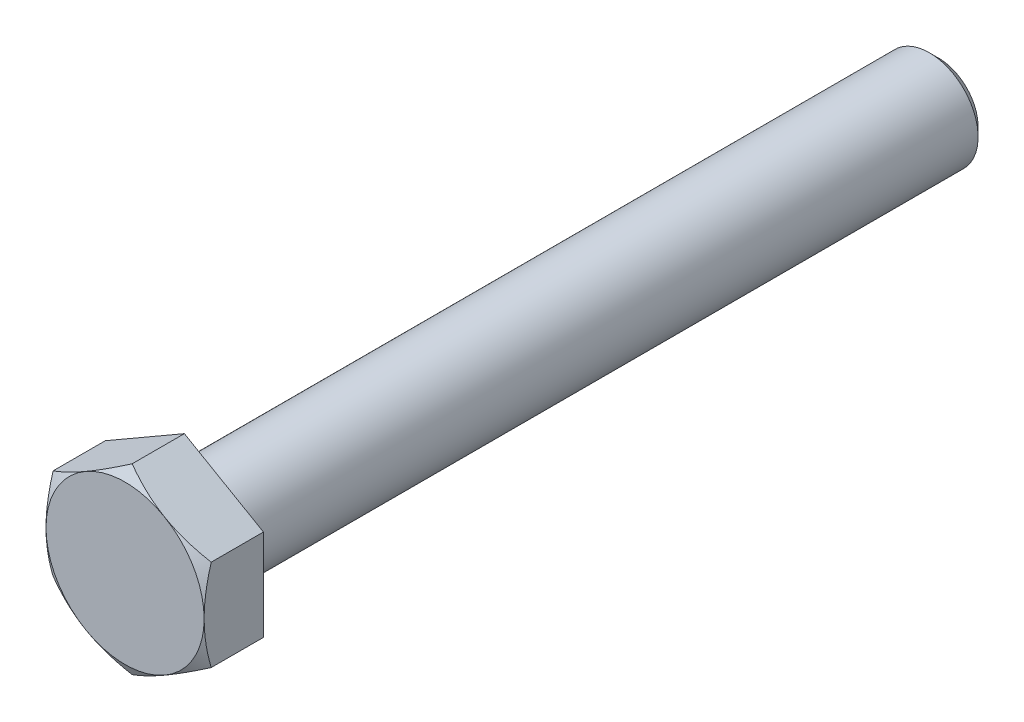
ISO-10303-21;
HEADER;
FILE_DESCRIPTION(('STEP AP214'),'2;1');
FILE_NAME('part.step','',(''),(''),'','','');
FILE_SCHEMA(('AUTOMOTIVE_DESIGN { 1 0 10303 214 1 1 1 1 }'));
ENDSEC;
DATA;
#1=APPLICATION_CONTEXT('core data for automotive mechanical design processes');
#2=APPLICATION_PROTOCOL_DEFINITION('international standard','automotive_design',2000,#1);
#3=PRODUCT_CONTEXT('',#1,'mechanical');
#4=PRODUCT('Part','Part','',(#3));
#5=PRODUCT_RELATED_PRODUCT_CATEGORY('part','',(#4));
#6=PRODUCT_DEFINITION_FORMATION('','',#4);
#7=PRODUCT_DEFINITION_CONTEXT('part definition',#1,'design');
#8=PRODUCT_DEFINITION('design','',#6,#7);
#9=PRODUCT_DEFINITION_SHAPE('','',#8);
#10=(LENGTH_UNIT() NAMED_UNIT(*) SI_UNIT(.MILLI.,.METRE.));
#11=(NAMED_UNIT(*) PLANE_ANGLE_UNIT() SI_UNIT($,.RADIAN.));
#12=(NAMED_UNIT(*) SI_UNIT($,.STERADIAN.) SOLID_ANGLE_UNIT());
#13=UNCERTAINTY_MEASURE_WITH_UNIT(LENGTH_MEASURE(1.E-05),#10,'distance_accuracy_value','');
#14=(GEOMETRIC_REPRESENTATION_CONTEXT(3) GLOBAL_UNCERTAINTY_ASSIGNED_CONTEXT((#13)) GLOBAL_UNIT_ASSIGNED_CONTEXT((#10,
#11,#12)) REPRESENTATION_CONTEXT('',''));
#15=CARTESIAN_POINT('',(0.,0.,0.));
#16=DIRECTION('',(0.,0.,1.));
#17=DIRECTION('',(1.,0.,0.));
#18=AXIS2_PLACEMENT_3D('',#15,#16,#17);
#19=CARTESIAN_POINT('',(0.,-23.8301323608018,27.6373335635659));
#20=DIRECTION('',(0.5,-0.866025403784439,0.));
#21=DIRECTION('',(0.866025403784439,0.5,0.));
#22=AXIS2_PLACEMENT_3D('',#19,#20,#21);
#23=PLANE('',#22);
#24=DIRECTION('',(0.,0.,1.));
#25=VECTOR('',#24,1.);
#26=CARTESIAN_POINT('',(20.6375,-11.9150661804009,27.6373335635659));
#27=LINE('',#26,#25);
#28=CARTESIAN_POINT('',(20.6375,-11.9150661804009,90.6859375));
#29=VERTEX_POINT('',#28);
#30=CARTESIAN_POINT('',(20.6375,-11.9150661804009,104.320795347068));
#31=VERTEX_POINT('',#30);
#32=EDGE_CURVE('E151',#29,#31,#27,.T.);
#33=ORIENTED_EDGE('',*,*,#32,.T.);
#34=CARTESIAN_POINT('',(20.6377,-11.9149507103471,104.320728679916));
#35=CARTESIAN_POINT('',(20.1840964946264,-12.1768388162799,104.471919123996));
#36=CARTESIAN_POINT('',(19.7287236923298,-12.4397484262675,104.616248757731));
#37=CARTESIAN_POINT('',(18.814326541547,-12.9676758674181,104.889279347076));
#38=CARTESIAN_POINT('',(18.3553010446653,-13.2326943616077,105.017975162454));
#39=CARTESIAN_POINT('',(17.4327113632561,-13.7653517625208,105.258008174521));
#40=CARTESIAN_POINT('',(16.9691391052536,-14.0329953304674,105.369304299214));
#41=CARTESIAN_POINT('',(16.0387734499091,-14.5701421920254,105.572148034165));
#42=CARTESIAN_POINT('',(15.571980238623,-14.8396453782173,105.663696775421));
#43=CARTESIAN_POINT('',(14.6471334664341,-15.3736059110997,105.823151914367));
#44=CARTESIAN_POINT('',(14.1891485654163,-15.6380236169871,105.891586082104));
#45=CARTESIAN_POINT('',(13.27108023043,-16.1680706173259,106.006334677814));
#46=CARTESIAN_POINT('',(12.8109967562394,-16.4336999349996,106.052648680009));
#47=CARTESIAN_POINT('',(11.890056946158,-16.9654047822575,106.12198753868));
#48=CARTESIAN_POINT('',(11.4292021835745,-17.2314794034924,106.145040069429));
#49=CARTESIAN_POINT('',(10.5070673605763,-17.7638741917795,106.167360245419));
#50=CARTESIAN_POINT('',(10.045787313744,-18.03019435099,106.166628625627));
#51=CARTESIAN_POINT('',(9.18341530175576,-18.528085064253,106.143041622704));
#52=CARTESIAN_POINT('',(8.78226192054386,-18.759691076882,106.123062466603));
#53=CARTESIAN_POINT('',(7.98091285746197,-19.2223501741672,106.065495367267));
#54=CARTESIAN_POINT('',(7.58071716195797,-19.453403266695,106.027907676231));
#55=CARTESIAN_POINT('',(6.78143133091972,-19.9148711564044,105.935774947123));
#56=CARTESIAN_POINT('',(6.38234252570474,-20.1452851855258,105.881214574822));
#57=CARTESIAN_POINT('',(5.5860758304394,-20.605009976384,105.756102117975));
#58=CARTESIAN_POINT('',(5.1888979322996,-20.8343207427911,105.685550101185));
#59=CARTESIAN_POINT('',(3.98315033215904,-21.530459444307,105.448095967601));
#60=CARTESIAN_POINT('',(3.17800639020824,-21.9953095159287,105.257504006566));
#61=CARTESIAN_POINT('',(1.97918213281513,-22.6874510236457,104.933030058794));
#62=CARTESIAN_POINT('',(1.58139951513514,-22.9171109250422,104.818557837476));
#63=CARTESIAN_POINT('',(0.788585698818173,-23.37484219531,104.578024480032));
#64=CARTESIAN_POINT('',(0.393553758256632,-23.6029139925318,104.451966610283));
#65=CARTESIAN_POINT('',(-0.000199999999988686,-23.8302478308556,104.320728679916));
#66=B_SPLINE_CURVE_WITH_KNOTS('',3,(#34,#35,#36,#37,#38,#39,#40,#41,#42,#43,#44,#45,#46,#47,#48,
#49,#50,#51,#52,#53,#54,#55,#56,#57,#58,#59,#60,#61,#62,#63,#64,#65),.UNSPECIFIED.,.F.,.F.,(4,2,
2,2,2,2,2,2,2,2,2,2,2,2,2,4),(0.,1.63552456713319,3.27158542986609,4.91145173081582,
6.55122408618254,8.1505234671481,9.74985363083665,11.3472788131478,12.9446546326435,
14.3352468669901,15.7258191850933,17.1176515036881,18.5094779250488,21.3544387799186,
22.7744411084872,24.1940443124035),.UNSPECIFIED.);
#67=CARTESIAN_POINT('',(10.31875,-17.8725992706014,106.1640625));
#68=VERTEX_POINT('',#67);
#69=EDGE_CURVE('E267',#31,#68,#66,.T.);
#70=ORIENTED_EDGE('',*,*,#69,.T.);
#71=CARTESIAN_POINT('',(0.,-23.8301323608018,104.320795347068));
#72=VERTEX_POINT('',#71);
#73=EDGE_CURVE('E194',#68,#72,#66,.T.);
#74=ORIENTED_EDGE('',*,*,#73,.T.);
#75=DIRECTION('',(0.,0.,1.));
#76=VECTOR('',#75,1.);
#77=CARTESIAN_POINT('',(0.,-23.8301323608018,27.6373335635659));
#78=LINE('',#77,#76);
#79=CARTESIAN_POINT('',(0.,-23.8301323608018,90.6859375));
#80=VERTEX_POINT('',#79);
#81=EDGE_CURVE('E287',#80,#72,#78,.T.);
#82=ORIENTED_EDGE('',*,*,#81,.F.);
#83=DIRECTION('',(0.866025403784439,0.5,0.));
#84=VECTOR('',#83,1.);
#85=CARTESIAN_POINT('',(0.,-23.8301323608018,90.6859375));
#86=LINE('',#85,#84);
#87=EDGE_CURVE('E149',#80,#29,#86,.T.);
#88=ORIENTED_EDGE('',*,*,#87,.T.);
#89=EDGE_LOOP('',(#33,#70,#74,#82,#88));
#90=FACE_BOUND('',#89,.T.);
#91=ADVANCED_FACE('F42',(#90),#23,.T.);
#92=CARTESIAN_POINT('',(20.6375,-11.9150661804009,27.6373335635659));
#93=DIRECTION('',(1.,0.,0.));
#94=DIRECTION('',(0.,0.,-1.));
#95=AXIS2_PLACEMENT_3D('',#92,#93,#94);
#96=PLANE('',#95);
#97=DIRECTION('',(0.,0.,1.));
#98=VECTOR('',#97,1.);
#99=CARTESIAN_POINT('',(20.6375,11.9150661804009,27.6373335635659));
#100=LINE('',#99,#98);
#101=CARTESIAN_POINT('',(20.6375,11.9150661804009,90.6859375));
#102=VERTEX_POINT('',#101);
#103=CARTESIAN_POINT('',(20.6375,11.9150661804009,104.320795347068));
#104=VERTEX_POINT('',#103);
#105=EDGE_CURVE('E300',#102,#104,#100,.T.);
#106=ORIENTED_EDGE('',*,*,#105,.T.);
#107=CARTESIAN_POINT('',(20.6375,-32.4256154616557,95.888087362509));
#108=CARTESIAN_POINT('',(20.6375,-31.9730806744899,96.1084981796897));
#109=CARTESIAN_POINT('',(20.6375,-31.5200260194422,96.3278411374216));
#110=CARTESIAN_POINT('',(20.6375,-30.612768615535,96.7641502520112));
#111=CARTESIAN_POINT('',(20.6375,-30.1585658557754,96.9811163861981));
#112=CARTESIAN_POINT('',(20.6375,-28.7939575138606,97.6281424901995));
#113=CARTESIAN_POINT('',(20.6375,-27.8816794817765,98.0542678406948));
#114=CARTESIAN_POINT('',(20.6375,-26.0463911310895,98.895731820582));
#115=CARTESIAN_POINT('',(20.6375,-25.123349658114,99.3110026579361));
#116=CARTESIAN_POINT('',(20.6375,-23.2700704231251,100.125105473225));
#117=CARTESIAN_POINT('',(20.6375,-22.3398329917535,100.523938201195));
#118=CARTESIAN_POINT('',(20.6375,-20.439323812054,101.313861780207));
#119=CARTESIAN_POINT('',(20.6375,-19.4687560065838,101.704243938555));
#120=CARTESIAN_POINT('',(20.6375,-17.5164156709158,102.456468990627));
#121=CARTESIAN_POINT('',(20.6375,-16.5346419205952,102.818308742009));
#122=CARTESIAN_POINT('',(20.6375,-14.5600631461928,103.504252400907));
#123=CARTESIAN_POINT('',(20.6375,-13.5672836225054,103.828429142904));
#124=CARTESIAN_POINT('',(20.6375,-11.5673985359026,104.428944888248));
#125=CARTESIAN_POINT('',(20.6375,-10.560297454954,104.705298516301));
#126=CARTESIAN_POINT('',(20.6375,-9.04144034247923,105.073428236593));
#127=CARTESIAN_POINT('',(20.6375,-8.53521428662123,105.188147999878));
#128=CARTESIAN_POINT('',(20.6375,-7.51922760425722,105.400787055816));
#129=CARTESIAN_POINT('',(20.6375,-7.00946704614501,105.498706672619));
#130=CARTESIAN_POINT('',(20.6375,-5.98674447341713,105.67604186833));
#131=CARTESIAN_POINT('',(20.6375,-5.47378260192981,105.755458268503));
#132=CARTESIAN_POINT('',(20.6375,-4.44513343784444,105.894225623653));
#133=CARTESIAN_POINT('',(20.6375,-3.92944614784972,105.953576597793));
#134=CARTESIAN_POINT('',(20.6375,-2.90301545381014,106.050260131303));
#135=CARTESIAN_POINT('',(20.6375,-2.39229917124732,106.087878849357));
#136=CARTESIAN_POINT('',(20.6375,-1.36973286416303,106.141466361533));
#137=CARTESIAN_POINT('',(20.6375,-0.857882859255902,106.157435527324));
#138=CARTESIAN_POINT('',(20.6375,0.166038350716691,106.167342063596));
#139=CARTESIAN_POINT('',(20.6375,0.678109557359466,106.161279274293));
#140=CARTESIAN_POINT('',(20.6375,1.70153150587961,106.127274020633));
#141=CARTESIAN_POINT('',(20.6375,2.21288221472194,106.099330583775));
#142=CARTESIAN_POINT('',(20.6375,3.42907871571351,106.007452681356));
#143=CARTESIAN_POINT('',(20.6375,4.13320752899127,105.933846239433));
#144=CARTESIAN_POINT('',(20.6375,5.53651886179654,105.749054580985));
#145=CARTESIAN_POINT('',(20.6375,6.23570074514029,105.637864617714));
#146=CARTESIAN_POINT('',(20.6375,7.6283451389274,105.381860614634));
#147=CARTESIAN_POINT('',(20.6375,8.32180314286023,105.237022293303));
#148=CARTESIAN_POINT('',(20.6375,9.70190431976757,104.918160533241));
#149=CARTESIAN_POINT('',(20.6375,10.3885475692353,104.744137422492));
#150=CARTESIAN_POINT('',(20.6375,11.7709004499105,104.366836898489));
#151=CARTESIAN_POINT('',(20.6375,12.4664487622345,104.162972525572));
#152=CARTESIAN_POINT('',(20.6375,13.8506972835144,103.733309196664));
#153=CARTESIAN_POINT('',(20.6375,14.5393974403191,103.507510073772));
#154=CARTESIAN_POINT('',(20.6375,15.9102893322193,103.037636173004));
#155=CARTESIAN_POINT('',(20.6375,16.5924828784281,102.79356665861));
#156=CARTESIAN_POINT('',(20.6375,17.611479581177,102.415977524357));
#157=CARTESIAN_POINT('',(20.6375,17.9504279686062,102.288200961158));
#158=CARTESIAN_POINT('',(20.6375,18.6269817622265,102.029136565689));
#159=CARTESIAN_POINT('',(20.6375,18.9645871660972,101.897848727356));
#160=CARTESIAN_POINT('',(20.6375,19.8670735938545,101.541934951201));
#161=CARTESIAN_POINT('',(20.6375,20.4308061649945,101.314394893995));
#162=CARTESIAN_POINT('',(20.6375,21.5550661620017,100.851514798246));
#163=CARTESIAN_POINT('',(20.6375,22.1155935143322,100.61617458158));
#164=CARTESIAN_POINT('',(20.6375,23.233806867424,100.138722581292));
#165=CARTESIAN_POINT('',(20.6375,23.7914926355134,99.8966102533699));
#166=CARTESIAN_POINT('',(20.6375,24.9042782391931,99.4065084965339));
#167=CARTESIAN_POINT('',(20.6375,25.4593780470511,99.1585190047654));
#168=CARTESIAN_POINT('',(20.6375,27.1216033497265,98.4067109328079));
#169=CARTESIAN_POINT('',(20.6375,28.2252618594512,97.8952217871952));
#170=CARTESIAN_POINT('',(20.6375,30.4250858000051,96.8565590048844));
#171=CARTESIAN_POINT('',(20.6375,31.5212515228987,96.3293859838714));
#172=CARTESIAN_POINT('',(20.6375,33.709278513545,95.2618893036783));
#173=CARTESIAN_POINT('',(20.6375,34.8011303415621,94.7215463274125));
#174=CARTESIAN_POINT('',(20.6375,36.9799230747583,93.6310445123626));
#175=CARTESIAN_POINT('',(20.6375,38.0668639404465,93.0808855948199));
#176=CARTESIAN_POINT('',(20.6375,40.2364746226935,91.9727781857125));
#177=CARTESIAN_POINT('',(20.6375,41.3191452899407,91.4148313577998));
#178=CARTESIAN_POINT('',(20.6375,43.4811328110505,90.292491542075));
#179=CARTESIAN_POINT('',(20.6375,44.5604496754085,89.7280985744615));
#180=CARTESIAN_POINT('',(20.6375,46.6038665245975,88.6531275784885));
#181=CARTESIAN_POINT('',(20.6375,47.5682435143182,88.1430756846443));
#182=CARTESIAN_POINT('',(20.6375,49.4950666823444,87.1193366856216));
#183=CARTESIAN_POINT('',(20.6375,50.4575128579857,86.6056495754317));
#184=CARTESIAN_POINT('',(20.6375,53.3424750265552,85.059887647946));
#185=CARTESIAN_POINT('',(20.6375,55.2625043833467,84.0231704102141));
#186=CARTESIAN_POINT('',(20.6375,58.1356204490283,82.4628746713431));
#187=CARTESIAN_POINT('',(20.6375,59.0905984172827,81.9427700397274));
#188=CARTESIAN_POINT('',(20.6375,60.999450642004,80.9005377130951));
#189=CARTESIAN_POINT('',(20.6375,61.9533248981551,80.3784100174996));
#190=CARTESIAN_POINT('',(20.6375,63.8600285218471,79.3324241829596));
#191=CARTESIAN_POINT('',(20.6375,64.8128579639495,78.8085661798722));
#192=CARTESIAN_POINT('',(20.6375,66.7176507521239,77.7592806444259));
#193=CARTESIAN_POINT('',(20.6375,67.6696140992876,77.2338531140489));
#194=CARTESIAN_POINT('',(20.6375,68.6211983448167,76.7077405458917));
#195=B_SPLINE_CURVE_WITH_KNOTS('',3,(#107,#108,#109,#110,#111,#112,#113,#114,#115,#116,#117,
#118,#119,#120,#121,#122,#123,#124,#125,#126,#127,#128,#129,#130,#131,#132,#133,#134,#135,#136,
#137,#138,#139,#140,#141,#142,#143,#144,#145,#146,#147,#148,#149,#150,#151,#152,#153,#154,#155,
#156,#157,#158,#159,#160,#161,#162,#163,#164,#165,#166,#167,#168,#169,#170,#171,#172,#173,#174,
#175,#176,#177,#178,#179,#180,#181,#182,#183,#184,#185,#186,#187,#188,#189,#190,#191,#192,#193,
#194),.UNSPECIFIED.,.F.,.F.,(4,2,2,2,2,2,2,2,2,2,2,2,2,2,2,2,2,2,2,2,2,2,2,2,2,2,2,2,2,2,2,2,2,
2,2,2,2,2,2,2,2,2,2,4),(0.,1.51006956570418,3.02015352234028,6.04074746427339,9.07708394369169,
12.1132817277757,15.2513462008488,18.3897556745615,21.5219911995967,24.6532671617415,
26.2102197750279,27.7671423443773,29.3239957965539,30.8808477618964,32.4167030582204,
33.9525319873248,35.4883720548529,37.024280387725,39.1470128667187,41.2700135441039,
43.3945510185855,45.5190646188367,47.6930602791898,49.867072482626,52.0404607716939,
53.1271447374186,54.2138305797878,56.0375227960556,57.8612566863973,59.6851375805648,
61.5090379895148,65.1581216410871,68.807062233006,72.4617221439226,76.1164113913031,
79.7703315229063,83.4242402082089,86.6970868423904,89.9699379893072,96.5160143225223,
99.7782862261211,103.040559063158,106.302581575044,109.564599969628),.UNSPECIFIED.);
#196=CARTESIAN_POINT('',(20.6375,0.,106.1640625));
#197=VERTEX_POINT('',#196);
#198=EDGE_CURVE('E118',#104,#197,#195,.F.);
#199=ORIENTED_EDGE('',*,*,#198,.T.);
#200=EDGE_CURVE('E158',#197,#31,#195,.F.);
#201=ORIENTED_EDGE('',*,*,#200,.T.);
#202=ORIENTED_EDGE('',*,*,#32,.F.);
#203=DIRECTION('',(0.,1.,0.));
#204=VECTOR('',#203,1.);
#205=CARTESIAN_POINT('',(20.6375,-11.9150661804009,90.6859375));
#206=LINE('',#205,#204);
#207=EDGE_CURVE('E293',#29,#102,#206,.T.);
#208=ORIENTED_EDGE('',*,*,#207,.T.);
#209=EDGE_LOOP('',(#106,#199,#201,#202,#208));
#210=FACE_BOUND('',#209,.T.);
#211=ADVANCED_FACE('F225',(#210),#96,.T.);
#212=CARTESIAN_POINT('',(20.6375,11.9150661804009,27.6373335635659));
#213=DIRECTION('',(0.5,0.866025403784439,0.));
#214=DIRECTION('',(-0.866025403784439,0.5,0.));
#215=AXIS2_PLACEMENT_3D('',#212,#213,#214);
#216=PLANE('',#215);
#217=DIRECTION('',(0.,0.,1.));
#218=VECTOR('',#217,1.);
#219=CARTESIAN_POINT('',(0.,23.8301323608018,27.6373335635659));
#220=LINE('',#219,#218);
#221=CARTESIAN_POINT('',(0.,23.8301323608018,90.6859375));
#222=VERTEX_POINT('',#221);
#223=CARTESIAN_POINT('',(0.,23.8301323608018,104.320795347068));
#224=VERTEX_POINT('',#223);
#225=EDGE_CURVE('E148',#222,#224,#220,.T.);
#226=ORIENTED_EDGE('',*,*,#225,.T.);
#227=CARTESIAN_POINT('',(-0.000199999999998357,23.8302478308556,104.320728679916));
#228=CARTESIAN_POINT('',(0.453403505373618,23.5683597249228,104.471919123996));
#229=CARTESIAN_POINT('',(0.908776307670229,23.3054501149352,104.616248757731));
#230=CARTESIAN_POINT('',(1.82317345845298,22.7775226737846,104.889279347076));
#231=CARTESIAN_POINT('',(2.2821989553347,22.512504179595,105.017975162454));
#232=CARTESIAN_POINT('',(3.20478863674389,21.9798467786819,105.258008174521));
#233=CARTESIAN_POINT('',(3.66836089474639,21.7122032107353,105.369304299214));
#234=CARTESIAN_POINT('',(4.59872655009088,21.1750563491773,105.572148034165));
#235=CARTESIAN_POINT('',(5.06551976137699,20.9055531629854,105.663696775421));
#236=CARTESIAN_POINT('',(5.99036653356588,20.371592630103,105.823151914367));
#237=CARTESIAN_POINT('',(6.44835143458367,20.1071749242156,105.891586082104));
#238=CARTESIAN_POINT('',(7.36641976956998,19.5771279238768,106.006334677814));
#239=CARTESIAN_POINT('',(7.82650324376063,19.3114986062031,106.052648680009));
#240=CARTESIAN_POINT('',(8.74744305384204,18.7797937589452,106.12198753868));
#241=CARTESIAN_POINT('',(9.20829781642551,18.5137191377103,106.145040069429));
#242=CARTESIAN_POINT('',(10.1304326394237,17.9813243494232,106.167360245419));
#243=CARTESIAN_POINT('',(10.591712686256,17.7150041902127,106.166628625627));
#244=CARTESIAN_POINT('',(11.4540846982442,17.2171134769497,106.143041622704));
#245=CARTESIAN_POINT('',(11.8552380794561,16.9855074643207,106.123062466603));
#246=CARTESIAN_POINT('',(12.656587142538,16.5228483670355,106.065495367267));
#247=CARTESIAN_POINT('',(13.056782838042,16.2917952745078,106.027907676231));
#248=CARTESIAN_POINT('',(13.8560686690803,15.8303273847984,105.935774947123));
#249=CARTESIAN_POINT('',(14.2551574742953,15.5999133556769,105.881214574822));
#250=CARTESIAN_POINT('',(15.0514241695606,15.1401885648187,105.756102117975));
#251=CARTESIAN_POINT('',(15.4486020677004,14.9108777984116,105.685550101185));
#252=CARTESIAN_POINT('',(16.654349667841,14.2147390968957,105.448095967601));
#253=CARTESIAN_POINT('',(17.4594936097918,13.749889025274,105.257504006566));
#254=CARTESIAN_POINT('',(18.6583178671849,13.057747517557,104.933030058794));
#255=CARTESIAN_POINT('',(19.0561004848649,12.8280876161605,104.818557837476));
#256=CARTESIAN_POINT('',(19.8489143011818,12.3703563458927,104.578024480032));
#257=CARTESIAN_POINT('',(20.2439462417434,12.1422845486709,104.451966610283));
#258=CARTESIAN_POINT('',(20.6377,11.9149507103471,104.320728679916));
#259=B_SPLINE_CURVE_WITH_KNOTS('',3,(#227,#228,#229,#230,#231,#232,#233,#234,#235,#236,#237,
#238,#239,#240,#241,#242,#243,#244,#245,#246,#247,#248,#249,#250,#251,#252,#253,#254,#255,#256,
#257,#258),.UNSPECIFIED.,.F.,.F.,(4,2,2,2,2,2,2,2,2,2,2,2,2,2,2,4),(0.,1.63552456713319,
3.27158542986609,4.91145173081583,6.55122408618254,8.1505234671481,9.74985363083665,
11.3472788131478,12.9446546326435,14.3352468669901,15.7258191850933,17.1176515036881,
18.5094779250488,21.3544387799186,22.7744411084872,24.1940443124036),.UNSPECIFIED.);
#260=CARTESIAN_POINT('',(10.31875,17.8725992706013,106.1640625));
#261=VERTEX_POINT('',#260);
#262=EDGE_CURVE('E123',#224,#261,#259,.T.);
#263=ORIENTED_EDGE('',*,*,#262,.T.);
#264=EDGE_CURVE('E114',#261,#104,#259,.T.);
#265=ORIENTED_EDGE('',*,*,#264,.T.);
#266=ORIENTED_EDGE('',*,*,#105,.F.);
#267=DIRECTION('',(-0.866025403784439,0.5,0.));
#268=VECTOR('',#267,1.);
#269=CARTESIAN_POINT('',(20.6375,11.9150661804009,90.6859375));
#270=LINE('',#269,#268);
#271=EDGE_CURVE('E297',#102,#222,#270,.T.);
#272=ORIENTED_EDGE('',*,*,#271,.T.);
#273=EDGE_LOOP('',(#226,#263,#265,#266,#272));
#274=FACE_BOUND('',#273,.T.);
#275=ADVANCED_FACE('F142',(#274),#216,.T.);
#276=CARTESIAN_POINT('',(0.,23.8301323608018,27.6373335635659));
#277=DIRECTION('',(-0.5,0.866025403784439,0.));
#278=DIRECTION('',(-0.866025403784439,-0.5,0.));
#279=AXIS2_PLACEMENT_3D('',#276,#277,#278);
#280=PLANE('',#279);
#281=DIRECTION('',(0.,0.,1.));
#282=VECTOR('',#281,1.);
#283=CARTESIAN_POINT('',(-20.6375,11.9150661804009,27.6373335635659));
#284=LINE('',#283,#282);
#285=CARTESIAN_POINT('',(-20.6375,11.9150661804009,90.6859375));
#286=VERTEX_POINT('',#285);
#287=CARTESIAN_POINT('',(-20.6375,11.9150661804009,104.320795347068));
#288=VERTEX_POINT('',#287);
#289=EDGE_CURVE('E290',#286,#288,#284,.T.);
#290=ORIENTED_EDGE('',*,*,#289,.T.);
#291=CARTESIAN_POINT('',(-20.6377,11.9149507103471,104.320728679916));
#292=CARTESIAN_POINT('',(-20.1840964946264,12.1768388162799,104.471919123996));
#293=CARTESIAN_POINT('',(-19.7287236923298,12.4397484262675,104.616248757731));
#294=CARTESIAN_POINT('',(-18.814326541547,12.9676758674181,104.889279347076));
#295=CARTESIAN_POINT('',(-18.3553010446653,13.2326943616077,105.017975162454));
#296=CARTESIAN_POINT('',(-17.4327113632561,13.7653517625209,105.258008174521));
#297=CARTESIAN_POINT('',(-16.9691391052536,14.0329953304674,105.369304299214));
#298=CARTESIAN_POINT('',(-16.0387734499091,14.5701421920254,105.572148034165));
#299=CARTESIAN_POINT('',(-15.571980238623,14.8396453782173,105.663696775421));
#300=CARTESIAN_POINT('',(-14.6471334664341,15.3736059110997,105.823151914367));
#301=CARTESIAN_POINT('',(-14.1891485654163,15.6380236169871,105.891586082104));
#302=CARTESIAN_POINT('',(-13.27108023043,16.1680706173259,106.006334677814));
#303=CARTESIAN_POINT('',(-12.8109967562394,16.4336999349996,106.052648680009));
#304=CARTESIAN_POINT('',(-11.890056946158,16.9654047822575,106.12198753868));
#305=CARTESIAN_POINT('',(-11.4292021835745,17.2314794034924,106.145040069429));
#306=CARTESIAN_POINT('',(-10.5070673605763,17.7638741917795,106.167360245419));
#307=CARTESIAN_POINT('',(-10.045787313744,18.03019435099,106.166628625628));
#308=CARTESIAN_POINT('',(-9.18341530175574,18.528085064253,106.143041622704));
#309=CARTESIAN_POINT('',(-8.78226192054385,18.759691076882,106.123062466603));
#310=CARTESIAN_POINT('',(-7.98091285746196,19.2223501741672,106.065495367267));
#311=CARTESIAN_POINT('',(-7.58071716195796,19.453403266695,106.027907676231));
#312=CARTESIAN_POINT('',(-6.78143133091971,19.9148711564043,105.935774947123));
#313=CARTESIAN_POINT('',(-6.38234252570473,20.1452851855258,105.881214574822));
#314=CARTESIAN_POINT('',(-5.58607583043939,20.605009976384,105.756102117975));
#315=CARTESIAN_POINT('',(-5.18889793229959,20.8343207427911,105.685550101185));
#316=CARTESIAN_POINT('',(-3.98315033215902,21.530459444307,105.448095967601));
#317=CARTESIAN_POINT('',(-3.17800639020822,21.9953095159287,105.257504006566));
#318=CARTESIAN_POINT('',(-1.97918213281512,22.6874510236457,104.933030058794));
#319=CARTESIAN_POINT('',(-1.58139951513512,22.9171109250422,104.818557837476));
#320=CARTESIAN_POINT('',(-0.788585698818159,23.37484219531,104.578024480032));
#321=CARTESIAN_POINT('',(-0.39355375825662,23.6029139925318,104.451966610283));
#322=CARTESIAN_POINT('',(0.00020000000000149,23.8302478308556,104.320728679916));
#323=B_SPLINE_CURVE_WITH_KNOTS('',3,(#291,#292,#293,#294,#295,#296,#297,#298,#299,#300,#301,
#302,#303,#304,#305,#306,#307,#308,#309,#310,#311,#312,#313,#314,#315,#316,#317,#318,#319,#320,
#321,#322),.UNSPECIFIED.,.F.,.F.,(4,2,2,2,2,2,2,2,2,2,2,2,2,2,2,4),(0.,1.63552456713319,
3.27158542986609,4.91145173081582,6.55122408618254,8.1505234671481,9.74985363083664,
11.3472788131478,12.9446546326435,14.3352468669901,15.7258191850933,17.1176515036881,
18.5094779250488,21.3544387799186,22.7744411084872,24.1940443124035),.UNSPECIFIED.);
#324=CARTESIAN_POINT('',(-10.31875,17.8725992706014,106.1640625));
#325=VERTEX_POINT('',#324);
#326=EDGE_CURVE('E201',#288,#325,#323,.T.);
#327=ORIENTED_EDGE('',*,*,#326,.T.);
#328=EDGE_CURVE('E122',#325,#224,#323,.T.);
#329=ORIENTED_EDGE('',*,*,#328,.T.);
#330=ORIENTED_EDGE('',*,*,#225,.F.);
#331=DIRECTION('',(-0.866025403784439,-0.5,0.));
#332=VECTOR('',#331,1.);
#333=CARTESIAN_POINT('',(0.,23.8301323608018,90.6859375));
#334=LINE('',#333,#332);
#335=EDGE_CURVE('E294',#222,#286,#334,.T.);
#336=ORIENTED_EDGE('',*,*,#335,.T.);
#337=EDGE_LOOP('',(#290,#327,#329,#330,#336));
#338=FACE_BOUND('',#337,.T.);
#339=ADVANCED_FACE('F210',(#338),#280,.T.);
#340=CARTESIAN_POINT('',(-20.6375,11.9150661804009,27.6373335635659));
#341=DIRECTION('',(-1.,0.,0.));
#342=DIRECTION('',(0.,-1.,0.));
#343=AXIS2_PLACEMENT_3D('',#340,#341,#342);
#344=PLANE('',#343);
#345=DIRECTION('',(0.,0.,1.));
#346=VECTOR('',#345,1.);
#347=CARTESIAN_POINT('',(-20.6375,-11.9150661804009,27.6373335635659));
#348=LINE('',#347,#346);
#349=CARTESIAN_POINT('',(-20.6375,-11.9150661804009,90.6859375));
#350=VERTEX_POINT('',#349);
#351=CARTESIAN_POINT('',(-20.6375,-11.9150661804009,104.320795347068));
#352=VERTEX_POINT('',#351);
#353=EDGE_CURVE('E280',#350,#352,#348,.T.);
#354=ORIENTED_EDGE('',*,*,#353,.T.);
#355=CARTESIAN_POINT('',(-20.6375,-32.4256154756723,95.8880873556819));
#356=CARTESIAN_POINT('',(-20.6375,-31.9730806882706,96.1084981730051));
#357=CARTESIAN_POINT('',(-20.6375,-31.5200260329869,96.3278411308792));
#358=CARTESIAN_POINT('',(-20.6375,-30.6127686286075,96.7641502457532));
#359=CARTESIAN_POINT('',(-20.6375,-30.1585658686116,96.9811163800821));
#360=CARTESIAN_POINT('',(-20.6375,-28.7939575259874,97.6281424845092));
#361=CARTESIAN_POINT('',(-20.6375,-27.8816794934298,98.0542678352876));
#362=CARTESIAN_POINT('',(-20.6375,-26.0463911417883,98.8957318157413));
#363=CARTESIAN_POINT('',(-20.6375,-25.123349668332,99.3110026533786));
#364=CARTESIAN_POINT('',(-20.6375,-23.2700704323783,100.125105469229));
#365=CARTESIAN_POINT('',(-20.6375,-22.3398330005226,100.523938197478));
#366=CARTESIAN_POINT('',(-20.6375,-20.439323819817,101.313861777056));
#367=CARTESIAN_POINT('',(-20.6375,-19.4687560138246,101.704243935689));
#368=CARTESIAN_POINT('',(-20.6375,-17.5164156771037,102.456468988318));
#369=CARTESIAN_POINT('',(-20.6375,-16.5346419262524,102.818308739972));
#370=CARTESIAN_POINT('',(-20.6375,-14.5600631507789,103.504252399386));
#371=CARTESIAN_POINT('',(-20.6375,-13.5672836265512,103.828429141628));
#372=CARTESIAN_POINT('',(-20.6375,-11.5673985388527,104.428944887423));
#373=CARTESIAN_POINT('',(-20.6375,-10.5602974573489,104.705298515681));
#374=CARTESIAN_POINT('',(-20.6375,-9.04144034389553,105.073428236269));
#375=CARTESIAN_POINT('',(-20.6375,-8.53521428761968,105.188147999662));
#376=CARTESIAN_POINT('',(-20.6375,-7.51922760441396,105.400787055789));
#377=CARTESIAN_POINT('',(-20.6375,-7.00946704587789,105.498706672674));
#378=CARTESIAN_POINT('',(-20.6375,-5.9867444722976,105.676041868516));
#379=CARTESIAN_POINT('',(-20.6375,-5.47378260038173,105.755458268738));
#380=CARTESIAN_POINT('',(-20.6375,-4.4451334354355,105.894225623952));
#381=CARTESIAN_POINT('',(-20.6375,-3.92944614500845,105.953576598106));
#382=CARTESIAN_POINT('',(-20.6375,-2.90301545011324,106.050260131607));
#383=CARTESIAN_POINT('',(-20.6375,-2.39229916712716,106.087878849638));
#384=CARTESIAN_POINT('',(-20.6375,-1.36973285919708,106.141466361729));
#385=CARTESIAN_POINT('',(-20.6375,-0.857882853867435,106.15743552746));
#386=CARTESIAN_POINT('',(-20.6375,0.166038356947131,106.167342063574));
#387=CARTESIAN_POINT('',(-20.6375,0.678109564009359,106.161279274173));
#388=CARTESIAN_POINT('',(-20.6375,1.70153151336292,106.127274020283));
#389=CARTESIAN_POINT('',(-20.6375,2.21288222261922,106.099330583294));
#390=CARTESIAN_POINT('',(-20.6375,3.42907872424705,106.007452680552));
#391=CARTESIAN_POINT('',(-20.6375,4.1332075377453,105.933846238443));
#392=CARTESIAN_POINT('',(-20.6375,5.53651887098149,105.749054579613));
#393=CARTESIAN_POINT('',(-20.6375,6.23570075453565,105.637864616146));
#394=CARTESIAN_POINT('',(-20.6375,7.62834514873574,105.381860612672));
#395=CARTESIAN_POINT('',(-20.6375,8.32180315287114,105.237022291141));
#396=CARTESIAN_POINT('',(-20.6375,9.70190433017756,104.918160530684));
#397=CARTESIAN_POINT('',(-20.6375,10.3885475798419,104.744137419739));
#398=CARTESIAN_POINT('',(-20.6375,11.7709004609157,104.366836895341));
#399=CARTESIAN_POINT('',(-20.6375,12.4664487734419,104.162972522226));
#400=CARTESIAN_POINT('',(-20.6375,13.8506972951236,103.733309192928));
#401=CARTESIAN_POINT('',(-20.6375,14.5393974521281,103.507510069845));
#402=CARTESIAN_POINT('',(-20.6375,15.9102893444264,103.0376361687));
#403=CARTESIAN_POINT('',(-20.6375,16.5924828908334,102.793566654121));
#404=CARTESIAN_POINT('',(-20.6375,17.6114795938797,102.415977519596));
#405=CARTESIAN_POINT('',(-20.6375,17.9504279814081,102.288200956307));
#406=CARTESIAN_POINT('',(-20.6375,18.6269817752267,102.02913656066));
#407=CARTESIAN_POINT('',(-20.6375,18.9645871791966,101.897848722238));
#408=CARTESIAN_POINT('',(-20.6375,19.8670736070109,101.541934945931));
#409=CARTESIAN_POINT('',(-20.6375,20.4308061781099,101.314394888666));
#410=CARTESIAN_POINT('',(-20.6375,21.5550661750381,100.851514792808));
#411=CARTESIAN_POINT('',(-20.6375,22.1155935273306,100.616174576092));
#412=CARTESIAN_POINT('',(-20.6375,23.2338068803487,100.138722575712));
#413=CARTESIAN_POINT('',(-20.6375,23.7914926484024,99.8966102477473));
#414=CARTESIAN_POINT('',(-20.6375,24.9042782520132,99.4065084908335));
#415=CARTESIAN_POINT('',(-20.6375,25.4593780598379,99.1585189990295));
#416=CARTESIAN_POINT('',(-20.6375,27.1216033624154,98.4067109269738));
#417=CARTESIAN_POINT('',(-20.6375,28.2252618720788,97.8952217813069));
#418=CARTESIAN_POINT('',(-20.6375,30.4250858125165,96.8565589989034));
#419=CARTESIAN_POINT('',(-20.6375,31.5212515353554,96.329385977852));
#420=CARTESIAN_POINT('',(-20.6375,33.7092785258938,95.2618892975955));
#421=CARTESIAN_POINT('',(-20.6375,34.8011303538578,94.7215463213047));
#422=CARTESIAN_POINT('',(-20.6375,36.979923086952,93.6310445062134));
#423=CARTESIAN_POINT('',(-20.6375,38.0668639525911,93.0808855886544));
#424=CARTESIAN_POINT('',(-20.6375,40.2364746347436,91.9727781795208));
#425=CARTESIAN_POINT('',(-20.6375,41.3191453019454,91.4148313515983));
#426=CARTESIAN_POINT('',(-20.6375,43.4811328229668,90.2924915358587));
#427=CARTESIAN_POINT('',(-20.6375,44.5604496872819,89.7280985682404));
#428=CARTESIAN_POINT('',(-20.6375,46.6038665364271,88.653127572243));
#429=CARTESIAN_POINT('',(-20.6375,47.5682435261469,88.1430756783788));
#430=CARTESIAN_POINT('',(-20.6375,49.4950666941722,87.1193366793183));
#431=CARTESIAN_POINT('',(-20.6375,50.4575128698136,86.6056495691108));
#432=CARTESIAN_POINT('',(-20.6375,53.3424750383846,85.0598876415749));
#433=CARTESIAN_POINT('',(-20.6375,55.262504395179,84.0231704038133));
#434=CARTESIAN_POINT('',(-20.6375,58.135620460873,82.4628746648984));
#435=CARTESIAN_POINT('',(-20.6375,59.0905984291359,81.9427700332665));
#436=CARTESIAN_POINT('',(-20.6375,60.9994506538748,80.9005377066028));
#437=CARTESIAN_POINT('',(-20.6375,61.9533249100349,80.3784100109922));
#438=CARTESIAN_POINT('',(-20.6375,63.8600285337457,79.3324241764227));
#439=CARTESIAN_POINT('',(-20.6375,64.8128579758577,78.8085661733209));
#440=CARTESIAN_POINT('',(-20.6375,66.7176507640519,77.7592806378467));
#441=CARTESIAN_POINT('',(-20.6375,67.6696141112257,77.2338531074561));
#442=CARTESIAN_POINT('',(-20.6375,68.621198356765,76.7077405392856));
#443=B_SPLINE_CURVE_WITH_KNOTS('',3,(#355,#356,#357,#358,#359,#360,#361,#362,#363,#364,#365,
#366,#367,#368,#369,#370,#371,#372,#373,#374,#375,#376,#377,#378,#379,#380,#381,#382,#383,#384,
#385,#386,#387,#388,#389,#390,#391,#392,#393,#394,#395,#396,#397,#398,#399,#400,#401,#402,#403,
#404,#405,#406,#407,#408,#409,#410,#411,#412,#413,#414,#415,#416,#417,#418,#419,#420,#421,#422,
#423,#424,#425,#426,#427,#428,#429,#430,#431,#432,#433,#434,#435,#436,#437,#438,#439,#440,#441,
#442),.UNSPECIFIED.,.F.,.F.,(4,2,2,2,2,2,2,2,2,2,2,2,2,2,2,2,2,2,2,2,2,2,2,2,2,2,2,2,2,2,2,2,2,
2,2,2,2,2,2,2,2,2,2,4),(0.,1.51006956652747,3.02015352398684,6.04074746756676,9.07708394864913,
12.1132817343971,15.2513462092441,18.3897556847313,21.5219912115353,24.6532671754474,
26.2102197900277,27.7671423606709,29.3239958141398,30.8808477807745,32.4167030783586,
33.952532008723,35.4883720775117,37.0242804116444,39.1470128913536,41.2700135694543,
43.3945510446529,45.519064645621,47.6930603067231,49.8670725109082,52.0404608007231,
53.1271447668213,54.2138306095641,56.0375228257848,57.8612567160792,59.6851376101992,
61.5090380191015,65.1581216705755,68.8070622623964,72.4617221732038,76.1164114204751,
79.7703315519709,83.424240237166,86.6970868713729,89.9699380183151,96.5160143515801,
99.7782862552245,103.040559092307,106.302581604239,109.564599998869),.UNSPECIFIED.);
#444=CARTESIAN_POINT('',(-20.6375,0.,106.1640625));
#445=VERTEX_POINT('',#444);
#446=EDGE_CURVE('E70',#352,#445,#443,.T.);
#447=ORIENTED_EDGE('',*,*,#446,.T.);
#448=EDGE_CURVE('E207',#445,#288,#443,.T.);
#449=ORIENTED_EDGE('',*,*,#448,.T.);
#450=ORIENTED_EDGE('',*,*,#289,.F.);
#451=DIRECTION('',(0.,-1.,0.));
#452=VECTOR('',#451,1.);
#453=CARTESIAN_POINT('',(-20.6375,11.9150661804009,90.6859375));
#454=LINE('',#453,#452);
#455=EDGE_CURVE('E281',#286,#350,#454,.T.);
#456=ORIENTED_EDGE('',*,*,#455,.T.);
#457=EDGE_LOOP('',(#354,#447,#449,#450,#456));
#458=FACE_BOUND('',#457,.T.);
#459=ADVANCED_FACE('F208',(#458),#344,.T.);
#460=CARTESIAN_POINT('',(-20.6375,-11.9150661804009,27.6373335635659));
#461=DIRECTION('',(-0.5,-0.866025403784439,0.));
#462=DIRECTION('',(0.866025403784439,-0.5,0.));
#463=AXIS2_PLACEMENT_3D('',#460,#461,#462);
#464=PLANE('',#463);
#465=ORIENTED_EDGE('',*,*,#81,.T.);
#466=CARTESIAN_POINT('',(0.000200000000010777,-23.8302478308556,104.320728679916));
#467=CARTESIAN_POINT('',(-0.453403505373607,-23.5683597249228,104.471919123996));
#468=CARTESIAN_POINT('',(-0.908776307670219,-23.3054501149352,104.616248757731));
#469=CARTESIAN_POINT('',(-1.82317345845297,-22.7775226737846,104.889279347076));
#470=CARTESIAN_POINT('',(-2.28219895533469,-22.512504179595,105.017975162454));
#471=CARTESIAN_POINT('',(-3.20478863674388,-21.9798467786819,105.258008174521));
#472=CARTESIAN_POINT('',(-3.66836089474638,-21.7122032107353,105.369304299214));
#473=CARTESIAN_POINT('',(-4.59872655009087,-21.1750563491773,105.572148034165));
#474=CARTESIAN_POINT('',(-5.06551976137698,-20.9055531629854,105.663696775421));
#475=CARTESIAN_POINT('',(-5.99036653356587,-20.371592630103,105.823151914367));
#476=CARTESIAN_POINT('',(-6.44835143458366,-20.1071749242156,105.891586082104));
#477=CARTESIAN_POINT('',(-7.36641976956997,-19.5771279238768,106.006334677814));
#478=CARTESIAN_POINT('',(-7.82650324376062,-19.3114986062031,106.052648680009));
#479=CARTESIAN_POINT('',(-8.74744305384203,-18.7797937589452,106.12198753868));
#480=CARTESIAN_POINT('',(-9.2082978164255,-18.5137191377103,106.145040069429));
#481=CARTESIAN_POINT('',(-10.1304326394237,-17.9813243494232,106.167360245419));
#482=CARTESIAN_POINT('',(-10.591712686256,-17.7150041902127,106.166628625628));
#483=CARTESIAN_POINT('',(-11.4540846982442,-17.2171134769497,106.143041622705));
#484=CARTESIAN_POINT('',(-11.8552380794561,-16.9855074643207,106.123062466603));
#485=CARTESIAN_POINT('',(-12.656587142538,-16.5228483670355,106.065495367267));
#486=CARTESIAN_POINT('',(-13.056782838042,-16.2917952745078,106.027907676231));
#487=CARTESIAN_POINT('',(-13.8560686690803,-15.8303273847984,105.935774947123));
#488=CARTESIAN_POINT('',(-14.2551574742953,-15.5999133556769,105.881214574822));
#489=CARTESIAN_POINT('',(-15.0514241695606,-15.1401885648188,105.756102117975));
#490=CARTESIAN_POINT('',(-15.4486020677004,-14.9108777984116,105.685550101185));
#491=CARTESIAN_POINT('',(-16.654349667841,-14.2147390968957,105.448095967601));
#492=CARTESIAN_POINT('',(-17.4594936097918,-13.749889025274,105.257504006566));
#493=CARTESIAN_POINT('',(-18.6583178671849,-13.057747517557,104.933030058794));
#494=CARTESIAN_POINT('',(-19.0561004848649,-12.8280876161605,104.818557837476));
#495=CARTESIAN_POINT('',(-19.8489143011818,-12.3703563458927,104.578024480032));
#496=CARTESIAN_POINT('',(-20.2439462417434,-12.142284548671,104.451966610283));
#497=CARTESIAN_POINT('',(-20.6377,-11.9149507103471,104.320728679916));
#498=B_SPLINE_CURVE_WITH_KNOTS('',3,(#466,#467,#468,#469,#470,#471,#472,#473,#474,#475,#476,
#477,#478,#479,#480,#481,#482,#483,#484,#485,#486,#487,#488,#489,#490,#491,#492,#493,#494,#495,
#496,#497),.UNSPECIFIED.,.F.,.F.,(4,2,2,2,2,2,2,2,2,2,2,2,2,2,2,4),(0.,1.63552456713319,
3.2715854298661,4.91145173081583,6.55122408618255,8.15052346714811,9.74985363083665,
11.3472788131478,12.9446546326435,14.3352468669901,15.7258191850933,17.1176515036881,
18.5094779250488,21.3544387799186,22.7744411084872,24.1940443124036),.UNSPECIFIED.);
#499=CARTESIAN_POINT('',(-10.31875,-17.8725992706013,106.1640625));
#500=VERTEX_POINT('',#499);
#501=EDGE_CURVE('E277',#72,#500,#498,.T.);
#502=ORIENTED_EDGE('',*,*,#501,.T.);
#503=EDGE_CURVE('E145',#500,#352,#498,.T.);
#504=ORIENTED_EDGE('',*,*,#503,.T.);
#505=ORIENTED_EDGE('',*,*,#353,.F.);
#506=DIRECTION('',(0.866025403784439,-0.5,0.));
#507=VECTOR('',#506,1.);
#508=CARTESIAN_POINT('',(-20.6375,-11.9150661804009,90.6859375));
#509=LINE('',#508,#507);
#510=EDGE_CURVE('E285',#350,#80,#509,.T.);
#511=ORIENTED_EDGE('',*,*,#510,.T.);
#512=EDGE_LOOP('',(#465,#502,#504,#505,#511));
#513=FACE_BOUND('',#512,.T.);
#514=ADVANCED_FACE('F176',(#513),#464,.T.);
#515=CARTESIAN_POINT('',(0.,20.6375,90.6859375));
#516=DIRECTION('',(0.,0.,-1.));
#517=DIRECTION('',(-1.,0.,0.));
#518=AXIS2_PLACEMENT_3D('',#515,#516,#517);
#519=PLANE('',#518);
#520=CARTESIAN_POINT('',(0.,0.,90.6859375));
#521=DIRECTION('',(0.,0.,-1.));
#522=DIRECTION('',(-1.,0.,0.));
#523=AXIS2_PLACEMENT_3D('',#520,#521,#522);
#524=CIRCLE('',#523,13.2080000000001);
#525=CARTESIAN_POINT('',(-13.2080000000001,0.,90.6859375));
#526=VERTEX_POINT('',#525);
#527=EDGE_CURVE('E12',#526,#526,#524,.F.);
#528=ORIENTED_EDGE('',*,*,#527,.T.);
#529=EDGE_LOOP('',(#528));
#530=FACE_BOUND('',#529,.T.);
#531=ORIENTED_EDGE('',*,*,#510,.F.);
#532=ORIENTED_EDGE('',*,*,#455,.F.);
#533=ORIENTED_EDGE('',*,*,#335,.F.);
#534=ORIENTED_EDGE('',*,*,#271,.F.);
#535=ORIENTED_EDGE('',*,*,#207,.F.);
#536=ORIENTED_EDGE('',*,*,#87,.F.);
#537=EDGE_LOOP('',(#531,#532,#533,#534,#535,#536));
#538=FACE_BOUND('',#537,.T.);
#539=ADVANCED_FACE('F216',(#530,#538),#519,.T.);
#540=CARTESIAN_POINT('',(0.,0.,-106.1640625));
#541=DIRECTION('',(0.,0.,-1.));
#542=DIRECTION('',(-1.,0.,0.));
#543=AXIS2_PLACEMENT_3D('',#540,#541,#542);
#544=CYLINDRICAL_SURFACE('',#543,12.7);
#545=CARTESIAN_POINT('',(0.,0.,90.1779375));
#546=DIRECTION('',(0.,0.,-1.));
#547=DIRECTION('',(-1.,0.,0.));
#548=AXIS2_PLACEMENT_3D('',#545,#546,#547);
#549=CIRCLE('',#548,12.7);
#550=CARTESIAN_POINT('',(-12.7,0.,90.1779375));
#551=VERTEX_POINT('',#550);
#552=EDGE_CURVE('E55',#551,#551,#549,.T.);
#553=ORIENTED_EDGE('',*,*,#552,.T.);
#554=EDGE_LOOP('',(#553));
#555=FACE_BOUND('',#554,.T.);
#556=CARTESIAN_POINT('',(0.,0.,-103.7828125));
#557=DIRECTION('',(0.,0.,-1.));
#558=DIRECTION('',(-1.,0.,0.));
#559=AXIS2_PLACEMENT_3D('',#556,#557,#558);
#560=CIRCLE('',#559,12.7000000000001);
#561=CARTESIAN_POINT('',(-12.7000000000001,0.,-103.7828125));
#562=VERTEX_POINT('',#561);
#563=EDGE_CURVE('E303',#562,#562,#560,.T.);
#564=ORIENTED_EDGE('',*,*,#563,.F.);
#565=EDGE_LOOP('',(#564));
#566=FACE_BOUND('',#565,.T.);
#567=ADVANCED_FACE('F238',(#555,#566),#544,.T.);
#568=CARTESIAN_POINT('',(0.,0.,-106.1640625));
#569=DIRECTION('',(0.,0.,1.));
#570=DIRECTION('',(1.,0.,0.));
#571=AXIS2_PLACEMENT_3D('',#568,#569,#570);
#572=CONICAL_SURFACE('',#571,10.31875,0.78539816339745);
#573=ORIENTED_EDGE('',*,*,#563,.T.);
#574=EDGE_LOOP('',(#573));
#575=FACE_BOUND('',#574,.T.);
#576=CARTESIAN_POINT('',(0.,0.,-106.1640625));
#577=DIRECTION('',(0.,0.,-1.));
#578=DIRECTION('',(-1.,0.,0.));
#579=AXIS2_PLACEMENT_3D('',#576,#577,#578);
#580=CIRCLE('',#579,10.31875);
#581=CARTESIAN_POINT('',(-10.31875,0.,-106.1640625));
#582=VERTEX_POINT('',#581);
#583=EDGE_CURVE('E301',#582,#582,#580,.T.);
#584=ORIENTED_EDGE('',*,*,#583,.F.);
#585=EDGE_LOOP('',(#584));
#586=FACE_BOUND('',#585,.T.);
#587=ADVANCED_FACE('F237',(#575,#586),#572,.T.);
#588=CARTESIAN_POINT('',(0.,10.31875,-106.1640625));
#589=DIRECTION('',(0.,0.,-1.));
#590=DIRECTION('',(-1.,0.,0.));
#591=AXIS2_PLACEMENT_3D('',#588,#589,#590);
#592=PLANE('',#591);
#593=ORIENTED_EDGE('',*,*,#583,.T.);
#594=EDGE_LOOP('',(#593));
#595=FACE_BOUND('',#594,.T.);
#596=ADVANCED_FACE('F231',(#595),#592,.T.);
#597=CARTESIAN_POINT('',(0.,0.,106.1640625));
#598=DIRECTION('',(0.,0.,-1.));
#599=DIRECTION('',(1.,0.,0.));
#600=AXIS2_PLACEMENT_3D('',#597,#598,#599);
#601=CONICAL_SURFACE('',#600,20.6375,1.0471975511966);
#602=CARTESIAN_POINT('',(0.,0.,106.1640625));
#603=DIRECTION('',(0.,0.,1.));
#604=DIRECTION('',(1.,0.,0.));
#605=AXIS2_PLACEMENT_3D('',#602,#603,#604);
#606=CIRCLE('',#605,20.6375);
#607=EDGE_CURVE('E140',#68,#197,#606,.T.);
#608=ORIENTED_EDGE('',*,*,#607,.F.);
#609=ORIENTED_EDGE('',*,*,#69,.F.);
#610=ORIENTED_EDGE('',*,*,#200,.F.);
#611=EDGE_LOOP('',(#608,#609,#610));
#612=FACE_BOUND('',#611,.T.);
#613=ADVANCED_FACE('F233',(#612),#601,.T.);
#614=EDGE_CURVE('E272',#500,#68,#606,.T.);
#615=ORIENTED_EDGE('',*,*,#614,.F.);
#616=ORIENTED_EDGE('',*,*,#501,.F.);
#617=ORIENTED_EDGE('',*,*,#73,.F.);
#618=EDGE_LOOP('',(#615,#616,#617));
#619=FACE_BOUND('',#618,.T.);
#620=ADVANCED_FACE('F171',(#619),#601,.T.);
#621=ORIENTED_EDGE('',*,*,#503,.F.);
#622=EDGE_CURVE('E271',#445,#500,#606,.T.);
#623=ORIENTED_EDGE('',*,*,#622,.F.);
#624=ORIENTED_EDGE('',*,*,#446,.F.);
#625=EDGE_LOOP('',(#621,#623,#624));
#626=FACE_BOUND('',#625,.T.);
#627=ADVANCED_FACE('F167',(#626),#601,.T.);
#628=ORIENTED_EDGE('',*,*,#448,.F.);
#629=EDGE_CURVE('E133',#325,#445,#606,.T.);
#630=ORIENTED_EDGE('',*,*,#629,.F.);
#631=ORIENTED_EDGE('',*,*,#326,.F.);
#632=EDGE_LOOP('',(#628,#630,#631));
#633=FACE_BOUND('',#632,.T.);
#634=ADVANCED_FACE('F174',(#633),#601,.T.);
#635=ORIENTED_EDGE('',*,*,#328,.F.);
#636=EDGE_CURVE('E127',#261,#325,#606,.T.);
#637=ORIENTED_EDGE('',*,*,#636,.F.);
#638=ORIENTED_EDGE('',*,*,#262,.F.);
#639=EDGE_LOOP('',(#635,#637,#638));
#640=FACE_BOUND('',#639,.T.);
#641=ADVANCED_FACE('F128',(#640),#601,.T.);
#642=CARTESIAN_POINT('',(0.,0.,106.1640625));
#643=DIRECTION('',(0.,0.,1.));
#644=DIRECTION('',(1.,0.,0.));
#645=AXIS2_PLACEMENT_3D('',#642,#643,#644);
#646=CIRCLE('',#645,20.6375);
#647=EDGE_CURVE('E56',#197,#261,#646,.T.);
#648=ORIENTED_EDGE('',*,*,#647,.F.);
#649=ORIENTED_EDGE('',*,*,#198,.F.);
#650=ORIENTED_EDGE('',*,*,#264,.F.);
#651=EDGE_LOOP('',(#648,#649,#650));
#652=FACE_BOUND('',#651,.T.);
#653=ADVANCED_FACE('F116',(#652),#601,.T.);
#654=CARTESIAN_POINT('',(0.,0.,106.1640625));
#655=DIRECTION('',(0.,0.,1.));
#656=DIRECTION('',(1.,0.,0.));
#657=AXIS2_PLACEMENT_3D('',#654,#655,#656);
#658=PLANE('',#657);
#659=ORIENTED_EDGE('',*,*,#607,.T.);
#660=ORIENTED_EDGE('',*,*,#647,.T.);
#661=ORIENTED_EDGE('',*,*,#636,.T.);
#662=ORIENTED_EDGE('',*,*,#629,.T.);
#663=ORIENTED_EDGE('',*,*,#622,.T.);
#664=ORIENTED_EDGE('',*,*,#614,.T.);
#665=EDGE_LOOP('',(#659,#660,#661,#662,#663,#664));
#666=FACE_BOUND('',#665,.T.);
#667=ADVANCED_FACE('F136',(#666),#658,.T.);
#668=CARTESIAN_POINT('',(0.,0.,90.1779375));
#669=DIRECTION('',(0.,0.,1.));
#670=DIRECTION('',(1.,0.,0.));
#671=AXIS2_PLACEMENT_3D('',#668,#669,#670);
#672=CONICAL_SURFACE('',#671,12.7,0.78539816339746);
#673=ORIENTED_EDGE('',*,*,#527,.F.);
#674=EDGE_LOOP('',(#673));
#675=FACE_BOUND('',#674,.T.);
#676=ORIENTED_EDGE('',*,*,#552,.F.);
#677=EDGE_LOOP('',(#676));
#678=FACE_BOUND('',#677,.T.);
#679=ADVANCED_FACE('F46',(#675,#678),#672,.T.);
#680=CLOSED_SHELL('',(#91,#211,#275,#339,#459,#514,#539,#567,#587,#596,#613,#620,#627,#634,#641,
#653,#667,#679));
#681=MANIFOLD_SOLID_BREP('B2',#680);
#682=ADVANCED_BREP_SHAPE_REPRESENTATION('',(#18,#681),#14);
#683=SHAPE_DEFINITION_REPRESENTATION(#9,#682);
ENDSEC;
END-ISO-10303-21;
